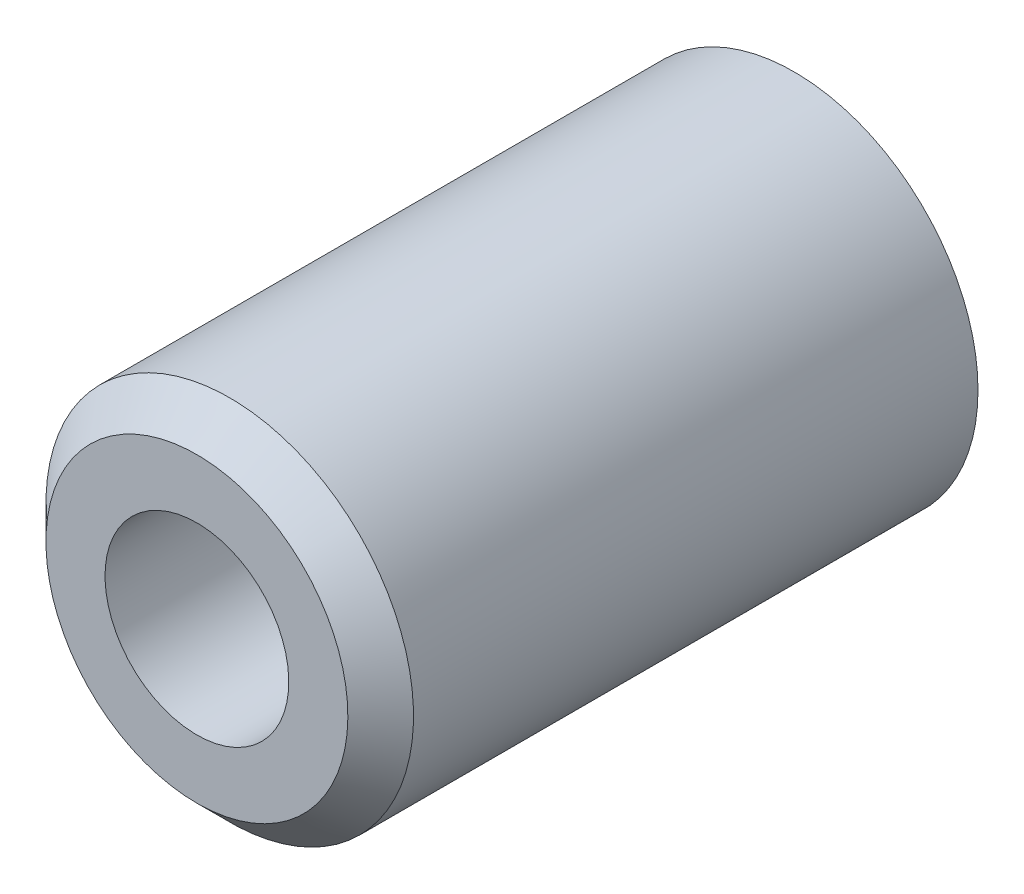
ISO-10303-21;
HEADER;
FILE_DESCRIPTION(('STEP AP214'),'2;1');
FILE_NAME('part.step','',(''),(''),'','','');
FILE_SCHEMA(('AUTOMOTIVE_DESIGN { 1 0 10303 214 1 1 1 1 }'));
ENDSEC;
DATA;
#1=APPLICATION_CONTEXT('core data for automotive mechanical design processes');
#2=APPLICATION_PROTOCOL_DEFINITION('international standard','automotive_design',2000,#1);
#3=PRODUCT_CONTEXT('',#1,'mechanical');
#4=PRODUCT('Part','Part','',(#3));
#5=PRODUCT_RELATED_PRODUCT_CATEGORY('part','',(#4));
#6=PRODUCT_DEFINITION_FORMATION('','',#4);
#7=PRODUCT_DEFINITION_CONTEXT('part definition',#1,'design');
#8=PRODUCT_DEFINITION('design','',#6,#7);
#9=PRODUCT_DEFINITION_SHAPE('','',#8);
#10=(LENGTH_UNIT() NAMED_UNIT(*) SI_UNIT(.MILLI.,.METRE.));
#11=(NAMED_UNIT(*) PLANE_ANGLE_UNIT() SI_UNIT($,.RADIAN.));
#12=(NAMED_UNIT(*) SI_UNIT($,.STERADIAN.) SOLID_ANGLE_UNIT());
#13=UNCERTAINTY_MEASURE_WITH_UNIT(LENGTH_MEASURE(1.E-05),#10,'distance_accuracy_value','');
#14=(GEOMETRIC_REPRESENTATION_CONTEXT(3) GLOBAL_UNCERTAINTY_ASSIGNED_CONTEXT((#13)) GLOBAL_UNIT_ASSIGNED_CONTEXT((#10,
#11,#12)) REPRESENTATION_CONTEXT('',''));
#15=CARTESIAN_POINT('',(0.,0.,0.));
#16=DIRECTION('',(0.,0.,1.));
#17=DIRECTION('',(1.,0.,0.));
#18=AXIS2_PLACEMENT_3D('',#15,#16,#17);
#19=CARTESIAN_POINT('',(0.,0.,-5.));
#20=DIRECTION('',(0.,0.,-1.));
#21=DIRECTION('',(-0.707106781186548,0.707106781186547,0.));
#22=AXIS2_PLACEMENT_3D('',#19,#20,#21);
#23=CYLINDRICAL_SURFACE('',#22,14.);
#24=CARTESIAN_POINT('',(0.,0.,64.));
#25=DIRECTION('',(0.,0.,-1.));
#26=DIRECTION('',(-0.707106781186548,0.707106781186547,0.));
#27=AXIS2_PLACEMENT_3D('',#24,#25,#26);
#28=CIRCLE('',#27,14.);
#29=CARTESIAN_POINT('',(-9.89949493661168,9.89949493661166,64.));
#30=VERTEX_POINT('',#29);
#31=EDGE_CURVE('E8',#30,#30,#28,.T.);
#32=ORIENTED_EDGE('',*,*,#31,.T.);
#33=EDGE_LOOP('',(#32));
#34=FACE_BOUND('',#33,.T.);
#35=CARTESIAN_POINT('',(0.,0.,21.));
#36=DIRECTION('',(0.,0.,1.));
#37=DIRECTION('',(1.,0.,0.));
#38=AXIS2_PLACEMENT_3D('',#35,#36,#37);
#39=CIRCLE('',#38,14.);
#40=CARTESIAN_POINT('',(14.,0.,21.));
#41=VERTEX_POINT('',#40);
#42=EDGE_CURVE('E31',#41,#41,#39,.T.);
#43=ORIENTED_EDGE('',*,*,#42,.T.);
#44=EDGE_LOOP('',(#43));
#45=FACE_BOUND('',#44,.T.);
#46=ADVANCED_FACE('F12',(#34,#45),#23,.T.);
#47=CARTESIAN_POINT('',(0.,0.,66.5));
#48=DIRECTION('',(0.,0.,-1.));
#49=DIRECTION('',(-0.707106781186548,0.707106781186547,0.));
#50=AXIS2_PLACEMENT_3D('',#47,#48,#49);
#51=CONICAL_SURFACE('',#50,11.5,0.785398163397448);
#52=ORIENTED_EDGE('',*,*,#31,.F.);
#53=EDGE_LOOP('',(#52));
#54=FACE_BOUND('',#53,.T.);
#55=CARTESIAN_POINT('',(0.,0.,66.5));
#56=DIRECTION('',(0.,0.,-1.));
#57=DIRECTION('',(-0.707106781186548,0.707106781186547,0.));
#58=AXIS2_PLACEMENT_3D('',#55,#56,#57);
#59=CIRCLE('',#58,11.5);
#60=CARTESIAN_POINT('',(-8.13172798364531,8.13172798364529,66.5));
#61=VERTEX_POINT('',#60);
#62=EDGE_CURVE('E18',#61,#61,#59,.T.);
#63=ORIENTED_EDGE('',*,*,#62,.T.);
#64=EDGE_LOOP('',(#63));
#65=FACE_BOUND('',#64,.T.);
#66=ADVANCED_FACE('F51',(#54,#65),#51,.T.);
#67=CARTESIAN_POINT('',(-8.1317279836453,-8.13172798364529,66.5));
#68=DIRECTION('',(0.,0.,-1.));
#69=DIRECTION('',(-0.707106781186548,0.707106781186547,0.));
#70=AXIS2_PLACEMENT_3D('',#67,#68,#69);
#71=PLANE('',#70);
#72=ORIENTED_EDGE('',*,*,#62,.F.);
#73=EDGE_LOOP('',(#72));
#74=FACE_BOUND('',#73,.T.);
#75=CARTESIAN_POINT('',(0.,0.,66.5));
#76=DIRECTION('',(0.,0.,-1.));
#77=DIRECTION('',(-0.707106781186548,0.707106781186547,0.));
#78=AXIS2_PLACEMENT_3D('',#75,#76,#77);
#79=CIRCLE('',#78,7.);
#80=CARTESIAN_POINT('',(-4.94974746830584,4.94974746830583,66.5));
#81=VERTEX_POINT('',#80);
#82=EDGE_CURVE('E22',#81,#81,#79,.T.);
#83=ORIENTED_EDGE('',*,*,#82,.T.);
#84=EDGE_LOOP('',(#83));
#85=FACE_BOUND('',#84,.T.);
#86=ADVANCED_FACE('F46',(#74,#85),#71,.F.);
#87=CARTESIAN_POINT('',(0.,0.,-5.));
#88=DIRECTION('',(0.,0.,-1.));
#89=DIRECTION('',(-0.707106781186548,0.707106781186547,0.));
#90=AXIS2_PLACEMENT_3D('',#87,#88,#89);
#91=CYLINDRICAL_SURFACE('',#90,7.);
#92=ORIENTED_EDGE('',*,*,#82,.F.);
#93=EDGE_LOOP('',(#92));
#94=FACE_BOUND('',#93,.T.);
#95=CARTESIAN_POINT('',(0.,0.,21.));
#96=DIRECTION('',(0.,0.,-1.));
#97=DIRECTION('',(-0.707106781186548,0.707106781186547,0.));
#98=AXIS2_PLACEMENT_3D('',#95,#96,#97);
#99=CIRCLE('',#98,7.);
#100=CARTESIAN_POINT('',(-4.94974746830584,4.94974746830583,21.));
#101=VERTEX_POINT('',#100);
#102=EDGE_CURVE('E26',#101,#101,#99,.T.);
#103=ORIENTED_EDGE('',*,*,#102,.T.);
#104=EDGE_LOOP('',(#103));
#105=FACE_BOUND('',#104,.T.);
#106=ADVANCED_FACE('F38',(#94,#105),#91,.F.);
#107=CARTESIAN_POINT('',(-9.89949493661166,-9.89949493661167,21.));
#108=DIRECTION('',(0.,0.,1.));
#109=DIRECTION('',(0.707106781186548,-0.707106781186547,0.));
#110=AXIS2_PLACEMENT_3D('',#107,#108,#109);
#111=PLANE('',#110);
#112=ORIENTED_EDGE('',*,*,#102,.F.);
#113=EDGE_LOOP('',(#112));
#114=FACE_BOUND('',#113,.T.);
#115=ORIENTED_EDGE('',*,*,#42,.F.);
#116=EDGE_LOOP('',(#115));
#117=FACE_BOUND('',#116,.T.);
#118=ADVANCED_FACE('F36',(#114,#117),#111,.F.);
#119=CLOSED_SHELL('',(#46,#66,#86,#106,#118));
#120=MANIFOLD_SOLID_BREP('B1',#119);
#121=ADVANCED_BREP_SHAPE_REPRESENTATION('',(#18,#120),#14);
#122=SHAPE_DEFINITION_REPRESENTATION(#9,#121);
ENDSEC;
END-ISO-10303-21;
